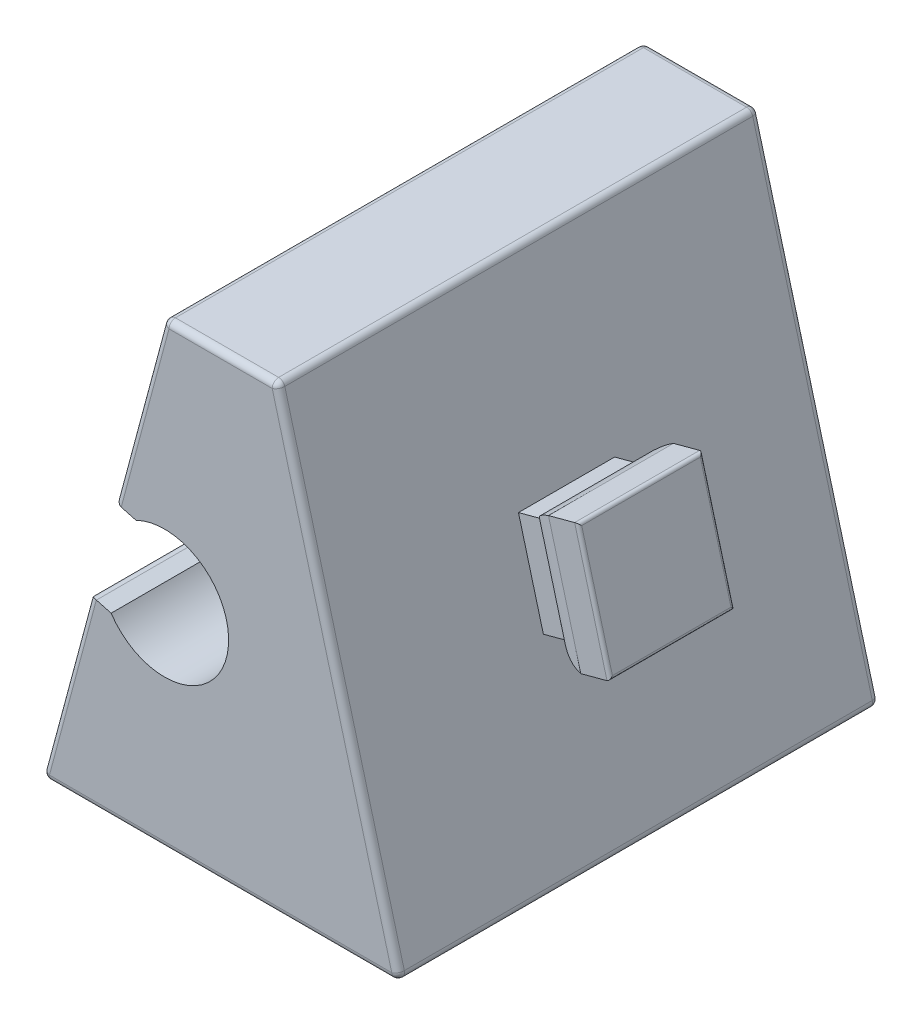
from build123d import *

# Parameters (mm, degrees)
EXTRUDE_1_DEPTH           = 15
CUT_EXTRUDE_1_DEPTH       = 15
SKETCH_5_W                = 3
SKETCH_5_H                = 3
EXTRUDE_2_DEPTH           = 0.68
EXTRUDE_3_DEPTH           = 5
EXTRUDE_3_DEPTH_BACK      = 5
CUT_EXTRUDE_11_DEPTH      = 5
CUT_EXTRUDE_11_DEPTH_BACK = 5
FILLET_1_R                = 0.2
FILLET_5_R                = 0.1


with BuildPart() as part:
    # Sketch 1 → Extrude 1 (new body)
    with BuildSketch(Plane.XY):
        Polygon((-5.6, 0), (5.6, 0), (1.762967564, 14.32), (-1.762967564, 14.32), align=None)
    extrude(amount=EXTRUDE_1_DEPTH)

    # Sketch 2 → Cut-Extrude 1 (cut)
    with BuildSketch(Plane.XY.offset(15)):
        with BuildLine():
            Line((-3.681483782, 7.16), (-4.06971235, 5.711111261))
            Line((-4.06971235, 5.711111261), (-3.415660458, 5.535858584))
            ThreePointArc((-3.415660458, 5.535858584), (0.182219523, 6.12472382), (-2.639203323, 8.433636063))
            Line((-2.639203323, 8.433636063), (-3.293255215, 8.608888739))
            Line((-3.293255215, 8.608888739), (-3.681483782, 7.16))
        make_face()
    extrude(amount=-CUT_EXTRUDE_1_DEPTH, mode=Mode.SUBTRACT)

    # Sketch 5 → Extrude 2 (add)
    with BuildSketch(Plane(origin=(5.224871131, 1.4, 0), x_dir=(0, 0, -1), z_dir=(0.9659258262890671, 0.2588190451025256, 0))):
        with Locations((-7.5, 5.963190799)):
            Rectangle(SKETCH_5_W, SKETCH_5_H)
    extrude(amount=EXTRUDE_2_DEPTH)

    # Sketch 6 → Extrude 3 (add, two sides: drawn at the far end of the back side and taken through both)
    with BuildSketch(Plane(origin=(-1.155158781, 4.311111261, 0), x_dir=(0.965925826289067, 0.2588190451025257, 0), z_dir=(0.2588190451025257, -0.965925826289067, 0)).offset(-EXTRUDE_3_DEPTH_BACK)):
        with BuildLine():
            Line((7.909184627, 5.55), (6.964774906, 5.55))
            ThreePointArc((6.964774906, 5.55), (6.497346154, 5.719957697), (6.086308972, 6))
            Line((6.086308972, 6), (6.086308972, 9))
            ThreePointArc((6.086308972, 9), (6.497346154, 9.280042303), (6.964774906, 9.45))
            Line((6.964774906, 9.45), (7.909184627, 9.45))
            Line((7.909184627, 9.45), (7.909184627, 5.55))
        make_face()
    extrude(amount=EXTRUDE_3_DEPTH + EXTRUDE_3_DEPTH_BACK)

    # Sketch 7 → Cut-Extrude 11 (cut, two sides: drawn at the far end of the back side and taken through both)
    with BuildSketch(Plane.XY.offset(9).offset(-CUT_EXTRUDE_11_DEPTH_BACK)):
        with BuildLine():
            Line((5.59160121, 9.690602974), (4.67937147, 9.446171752))
            ThreePointArc((4.67937147, 9.446171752), (4.271858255, 9.16102576), (3.947307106, 8.784141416))
            Line((3.947307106, 8.784141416), (3.429669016, 10.715993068))
            Line((3.429669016, 10.715993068), (4.27820195, 10.943356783))
            Line((4.27820195, 10.943356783), (5.19043169, 11.187788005))
            Line((5.19043169, 11.187788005), (5.59160121, 9.690602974))
        make_face()
        with BuildLine():
            Line((6.600995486, 5.923492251), (5.688765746, 5.679061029))
            ThreePointArc((5.688765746, 5.679061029), (5.193275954, 5.722248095), (4.723764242, 5.886363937))
            Line((4.723764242, 5.886363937), (6.017859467, 1.056734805))
            Line((6.017859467, 1.056734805), (6.866392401, 1.28409852))
            Line((6.866392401, 1.28409852), (7.778622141, 1.528529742))
            Line((7.778622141, 1.528529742), (6.600995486, 5.923492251))
        make_face()
    extrude(amount=CUT_EXTRUDE_11_DEPTH + CUT_EXTRUDE_11_DEPTH_BACK, mode=Mode.SUBTRACT)

    # Fillet 1
    fillet_1_edges = [part.edges().sort_by_distance(p)[0] for p in [
        (0, 0, 15),
        (3.681483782, 7.16, 15),
        (-4.834856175, 2.85555563, 0),
        (-4.834856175, 2.85555563, 15),
        (-3.293255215, 8.608888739, 7.5),
        (-4.06971235, 5.711111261, 7.5),
        (0, 14.32, 15),
        (3.681483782, 7.16, 0),
        (0, 0, 0),
        (-2.528111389, 11.46444437, 0),
        (0, 14.32, 0),
        (-2.528111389, 11.46444437, 15),
        (1.762967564, 14.32, 7.5),
        (5.6, 0, 7.5),
        (-5.6, 0, 7.5),
        (-1.762967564, 14.32, 7.5),
    ]]
    fillet(fillet_1_edges, radius=FILLET_1_R)

    # Fillet 5
    fillet_5_edges = [part.edges().sort_by_distance(p)[0] for p in [
        (6.096298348, 7.807047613, 9.45),
        (6.096298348, 7.807047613, 5.55),
        (5.59160121, 9.690602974, 7.5),
        (6.600995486, 5.923492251, 7.5),
    ]]
    fillet(fillet_5_edges, radius=FILLET_5_R)


solid = part.part
